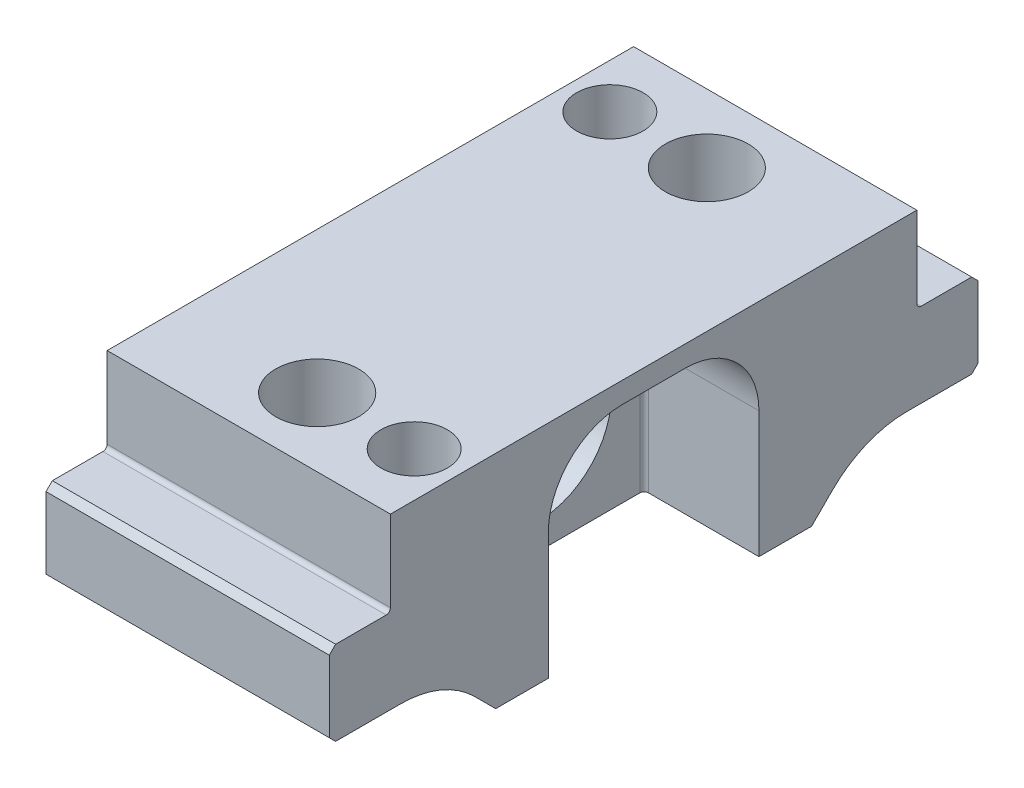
from build123d import *

# Parameters (mm, degrees)
SKETCH1_W                                  = 34.163
SKETCH1_H                                  = 26.67
BOSS_EXTRUDE1_DEPTH                        = 40.64
CUT_EXTRUDE1_WAY_CUTS_DEPTH                = 55.740683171
SKETCH5_R                                  = 8.7503
CUT_EXTRUDE4_THREADED_HOLE_DEPTH           = 54.618972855
SKETCH6_W                                  = 25.4
SKETCH6_H                                  = 24.13
CUT_EXTRUDE5_THREAD_RELIEF_DEPTH           = 13.843
FILLET3_R                                  = 12.7
FILLET7_R                                  = 8.89
FILLET5_R                                  = 0.508
CHAMFER1_SIZE                              = 0.762
FILLET6_R                                  = 0.508
M10X1_5_TAPPED_HOLE1_JAW_MOUNT_D           = 8.5
M10X1_5_TAPPED_HOLE1_JAW_MOUNT_CBORE_D     = 10
M10X1_5_TAPPED_HOLE1_JAW_MOUNT_CBORE_DEPTH = 17.78
SKETCH9_R                                  = 4.00939
F_8MM_DOWEL_PIN_JAW_LOCATION_DEPTH         = 6.858
CUT_EXTRUDER_DEPTH                         = 0.127


with BuildPart() as part:
    # Sketch1 → Boss-Extrude1 (new, symmetric)
    with BuildSketch(Plane.XY):
        Rectangle(SKETCH1_W, SKETCH1_H)
    extrude(amount=BOSS_EXTRUDE1_DEPTH, both=True)

    # Sketch2 → Cut-Extrude1 WAY CUTS (cut, through all)
    with BuildSketch(Plane(origin=(17.0815, 0, 0), x_dir=(0, 0, -1), z_dir=(1, 0, 0))):
        Polygon((-39.116, 3.048), (-39.116, -7.0993), (-25.2857, -7.0993), (-19.05, -13.335), (-40.64, -13.335), (-40.64, 13.335), (-31.74365, 13.335), (-31.74365, 3.048), align=None)
        Polygon((40.64, 13.335), (40.64, -13.335), (19.05, -13.335), (25.2857, -7.0993), (39.116, -7.0993), (39.116, 3.048), (31.74365, 3.048), (31.74365, 13.335), align=None)
    extrude(amount=-CUT_EXTRUDE1_WAY_CUTS_DEPTH, mode=Mode.SUBTRACT)

    # Sketch5 → Cut-Extrude4 THREADED HOLE (cut, through all)
    with BuildSketch(Plane(origin=(17.0815, 0, 0), x_dir=(0, 0, -1), z_dir=(1, 0, 0))):
        with Locations((0, -1.4097)):
            Circle(SKETCH5_R)
    extrude(amount=-CUT_EXTRUDE4_THREADED_HOLE_DEPTH, mode=Mode.SUBTRACT)

    # Sketch6 → Cut-Extrude5 THREAD RELIEF (cut)
    with BuildSketch(Plane(origin=(17.0815, 0, 0), x_dir=(0, 0, -1), z_dir=(1, 0, 0))):
        with Locations((0, -1.27)):
            Rectangle(SKETCH6_W, SKETCH6_H)
    extrude(amount=-CUT_EXTRUDE5_THREAD_RELIEF_DEPTH, mode=Mode.SUBTRACT)

    # Fillet3
    fillet3_edges = [part.edges().sort_by_distance(p)[0] for p in [
        (0, -7.0993, 25.2857),
        (0, -7.0993, -25.2857),
    ]]
    fillet(fillet3_edges, radius=FILLET3_R)

    # Fillet7
    fillet7_edges = [part.edges().sort_by_distance(p)[0] for p in [
        (10.16, 10.795, 12.7),
        (10.16, 10.795, -12.7),
    ]]
    fillet(fillet7_edges, radius=FILLET7_R)

    # Fillet5
    fillet5_edges = [part.edges().sort_by_distance(p)[0] for p in [
        (0, 3.048, 31.74365),
        (0, 3.048, -31.74365),
    ]]
    fillet(fillet5_edges, radius=FILLET5_R)

    # Chamfer1
    chamfer1_edges = [part.edges().sort_by_distance(p)[0] for p in [
        (0, 3.048, 39.116),
        (0, -7.0993, 39.116),
        (0, -7.0993, -39.116),
        (0, 3.048, -39.116),
    ]]
    chamfer(chamfer1_edges, length=CHAMFER1_SIZE)

    # Fillet6
    fillet6_edges = [part.edges().sort_by_distance(p)[0] for p in [
        (3.2385, 10.795, 0),
        (3.2385, -5.715, -12.7),
        (3.2385, 8.191179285, 10.096179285),
        (3.2385, 8.191179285, -10.096179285),
        (3.2385, -5.715, 12.7),
    ]]
    fillet(fillet6_edges, radius=FILLET6_R)

    # M10x1.5 Tapped Hole1 JAW MOUNT (through all)
    with Locations(Plane(origin=(0, 13.335, 0), x_dir=(-1, 0, 0), z_dir=(0, 1, 0))):
        with Locations((0, -23.495), (0, 23.495)):
            CounterBoreHole(M10X1_5_TAPPED_HOLE1_JAW_MOUNT_D / 2, M10X1_5_TAPPED_HOLE1_JAW_MOUNT_CBORE_D / 2, M10X1_5_TAPPED_HOLE1_JAW_MOUNT_CBORE_DEPTH)

    # Sketch9 → 8MM DOWEL PIN JAW LOCATION (cut)
    with BuildSketch(Plane(origin=(0, 13.335, 0), x_dir=(1, 0, 0), z_dir=(0, 1, 0))):
        with Locations(Location((-11.7, 23.5, 0), (0, 0, 180))):
            Circle(SKETCH9_R)
        with Locations((11.7, -23.5)):
            Circle(SKETCH9_R)
    extrude(amount=-F_8MM_DOWEL_PIN_JAW_LOCATION_DEPTH, mode=Mode.SUBTRACT)

    # Sketch21 → Cut-ExtrudeR (cut)
    with BuildSketch(Plane.ZY.offset(17.0815)):
        with BuildLine():
            Line((17.301227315, 2.040047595), (18.571990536, 2.040047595))
            add(Edge.make_bspline(
                [(18.571990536, 2.040047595), (18.656792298, 2.039765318), (18.819621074, 2.039223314), (19.052889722, 2.036201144), (19.264847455, 2.027539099), (19.455383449, 2.020084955), (19.624494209, 2.006492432), (19.772698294, 1.993500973), (19.899313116, 1.976494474), (19.975959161, 1.960700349), (20.010662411, 1.953549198)],
                knots=[0, 0, 0, 0, 1.410062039, 2.707475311, 3.878576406, 4.937260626, 5.877586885, 6.699081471, 7.410979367, 8, 8, 8, 8], degree=3))
            add(Edge.make_bspline(
                [(20.010662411, 1.953549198), (20.057120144, 1.942070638), (20.149044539, 1.919358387), (20.281396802, 1.871353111), (20.407515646, 1.815800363), (20.526877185, 1.750551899), (20.638883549, 1.675123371), (20.744689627, 1.59081692), (20.844775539, 1.498093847), (20.93509364, 1.394616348), (21.020254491, 1.286055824), (21.09207957, 1.168664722), (21.153994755, 1.045907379), (21.203289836, 0.91653535), (21.24298273, 0.781803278), (21.270970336, 0.640490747), (21.287754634, 0.493241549), (21.289463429, 0.392806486), (21.290329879, 0.341880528)],
                knots=[0, 0, 0, 0, 1.027469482, 2.033020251, 3.019912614, 3.986113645, 4.951240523, 5.91722682, 6.890402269, 7.87763091, 8.8651537, 9.85103654, 10.82876324, 11.815024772, 12.821070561, 13.842952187, 14.906261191, 16, 16, 16, 16], degree=3))
            add(Edge.make_bspline(
                [(21.290329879, 0.341880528), (21.287664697, 0.257271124), (21.282464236, 0.092176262), (21.233977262, -0.147419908), (21.154554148, -0.370920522), (21.045110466, -0.578044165), (20.905737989, -0.764753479), (20.738234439, -0.92874759), (20.542506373, -1.065980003), (20.3602989, -1.161144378), (20.199345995, -1.222091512), (20.066842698, -1.26497462), (19.922304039, -1.298107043), (19.767114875, -1.327788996), (19.600629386, -1.350198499), (19.4232466, -1.366611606), (19.234840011, -1.376869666), (19.105410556, -1.378397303), (19.038827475, -1.379183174)],
                knots=[0, 0, 0, 0, 1.260483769, 2.459530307, 3.627416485, 4.787058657, 5.939039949, 7.08810263, 8.267026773, 9.491475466, 10.141966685, 10.831826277, 11.566392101, 12.351337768, 13.187381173, 14.07005841, 15.007169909, 16, 16, 16, 16], degree=3))
            Line((19.038827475, -1.379183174), (21.371740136, -4.309952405))
            Line((21.371740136, -4.309952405), (20.667032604, -4.309952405))
            Line((20.667032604, -4.309952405), (18.334119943, -1.379183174))
            Line((18.334119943, -1.379183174), (17.87109911, -1.379183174))
            Line((17.87109911, -1.379183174), (17.87109911, -4.309952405))
            Line((17.87109911, -4.309952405), (17.301227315, -4.309952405))
            Line((17.301227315, -4.309952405), (17.301227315, 2.040047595))
        make_face()
        with BuildLine():
            Line((17.87109911, 1.388765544), (17.87109911, -0.727901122))
            Line((17.87109911, -0.727901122), (19.033739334, -0.736805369))
            add(Edge.make_bspline(
                [(19.033739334, -0.736805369), (19.088022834, -0.736829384), (19.193239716, -0.736875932), (19.345459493, -0.729630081), (19.487191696, -0.721387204), (19.617894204, -0.708779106), (19.737625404, -0.692530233), (19.846325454, -0.672204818), (19.944171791, -0.648524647), (20.058287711, -0.611873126), (20.185716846, -0.553805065), (20.324203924, -0.469321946), (20.442136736, -0.363060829), (20.541773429, -0.241551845), (20.621836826, -0.107954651), (20.678282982, 0.036129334), (20.714101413, 0.187062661), (20.71832606, 0.290800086), (20.720458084, 0.343152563)],
                knots=[0, 0, 0, 0, 1.146690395, 2.22261258, 3.21895312, 4.145990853, 4.996080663, 5.770904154, 6.481378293, 7.121626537, 8.300444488, 9.431385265, 10.535395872, 11.636531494, 12.74115979, 13.810798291, 14.895190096, 16, 16, 16, 16], degree=3))
            add(Edge.make_bspline(
                [(20.720458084, 0.343152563), (20.718277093, 0.39421849), (20.713955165, 0.495412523), (20.678669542, 0.643559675), (20.618998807, 0.783381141), (20.538585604, 0.914308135), (20.440615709, 1.033154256), (20.325739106, 1.134839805), (20.197096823, 1.218749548), (20.076861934, 1.272369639), (19.969394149, 1.30524423), (19.876086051, 1.328378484), (19.770655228, 1.346964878), (19.652589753, 1.361856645), (19.522393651, 1.37465633), (19.379408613, 1.383277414), (19.224583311, 1.388382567), (19.117273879, 1.388634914), (19.06172411, 1.388765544)],
                knots=[0, 0, 0, 0, 1.101028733, 2.181837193, 3.264309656, 4.369019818, 5.486613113, 6.575447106, 7.666700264, 8.788928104, 9.402425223, 10.0903467, 10.862060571, 11.710948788, 12.657782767, 13.684531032, 14.801375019, 16, 16, 16, 16], degree=3))
            Line((19.06172411, 1.388765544), (17.87109911, 1.388765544))
        make_face(mode=Mode.SUBTRACT)
    extrude(amount=-CUT_EXTRUDER_DEPTH, mode=Mode.SUBTRACT)


solid = part.part
